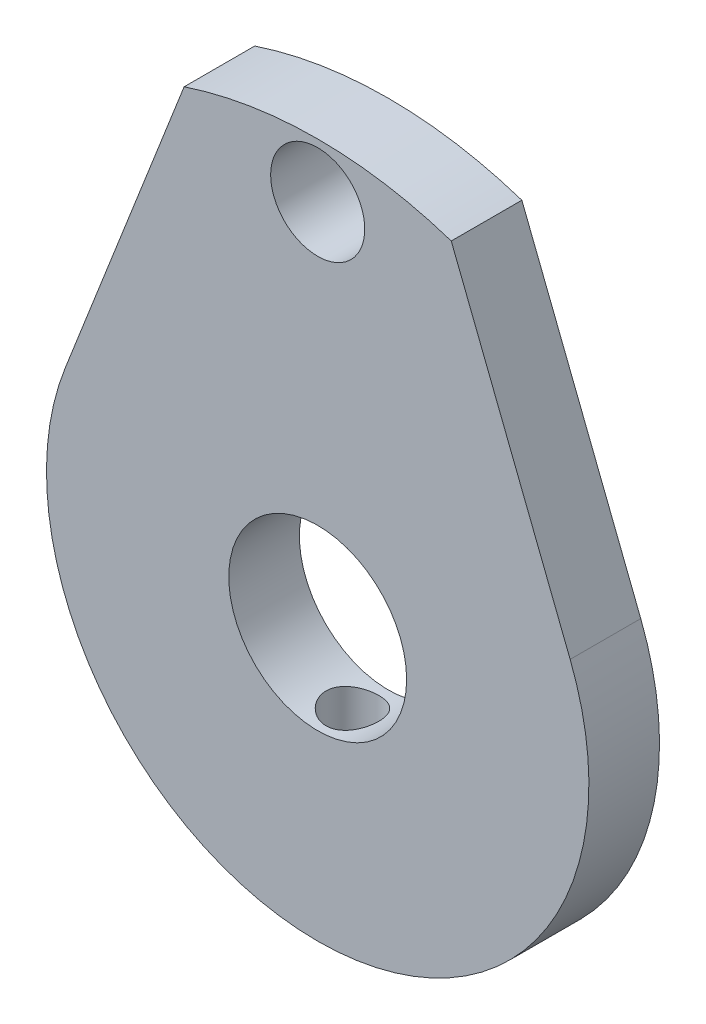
ISO-10303-21;
HEADER;
FILE_DESCRIPTION(('STEP AP214'),'2;1');
FILE_NAME('part.step','',(''),(''),'','','');
FILE_SCHEMA(('AUTOMOTIVE_DESIGN { 1 0 10303 214 1 1 1 1 }'));
ENDSEC;
DATA;
#1=APPLICATION_CONTEXT('core data for automotive mechanical design processes');
#2=APPLICATION_PROTOCOL_DEFINITION('international standard','automotive_design',2000,#1);
#3=PRODUCT_CONTEXT('',#1,'mechanical');
#4=PRODUCT('Part','Part','',(#3));
#5=PRODUCT_RELATED_PRODUCT_CATEGORY('part','',(#4));
#6=PRODUCT_DEFINITION_FORMATION('','',#4);
#7=PRODUCT_DEFINITION_CONTEXT('part definition',#1,'design');
#8=PRODUCT_DEFINITION('design','',#6,#7);
#9=PRODUCT_DEFINITION_SHAPE('','',#8);
#10=(LENGTH_UNIT() NAMED_UNIT(*) SI_UNIT(.MILLI.,.METRE.));
#11=(NAMED_UNIT(*) PLANE_ANGLE_UNIT() SI_UNIT($,.RADIAN.));
#12=(NAMED_UNIT(*) SI_UNIT($,.STERADIAN.) SOLID_ANGLE_UNIT());
#13=UNCERTAINTY_MEASURE_WITH_UNIT(LENGTH_MEASURE(1.E-05),#10,'distance_accuracy_value','');
#14=(GEOMETRIC_REPRESENTATION_CONTEXT(3) GLOBAL_UNCERTAINTY_ASSIGNED_CONTEXT((#13)) GLOBAL_UNIT_ASSIGNED_CONTEXT((#10,
#11,#12)) REPRESENTATION_CONTEXT('',''));
#15=CARTESIAN_POINT('',(0.,0.,0.));
#16=DIRECTION('',(0.,0.,1.));
#17=DIRECTION('',(1.,0.,0.));
#18=AXIS2_PLACEMENT_3D('',#15,#16,#17);
#19=CARTESIAN_POINT('',(0.,0.,0.));
#20=DIRECTION('',(0.,0.,0.999999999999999));
#21=DIRECTION('',(1.,0.,0.));
#22=AXIS2_PLACEMENT_3D('',#19,#20,#21);
#23=CYLINDRICAL_SURFACE('',#22,9.14770787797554);
#24=CARTESIAN_POINT('',(0.,0.,2.38125000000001));
#25=DIRECTION('',(0.,0.,0.999999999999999));
#26=DIRECTION('',(1.,0.,0.));
#27=AXIS2_PLACEMENT_3D('',#24,#25,#26);
#28=CIRCLE('',#27,9.14770787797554);
#29=CARTESIAN_POINT('',(-8.51512171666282,3.34264290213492,2.38125000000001));
#30=VERTEX_POINT('',#29);
#31=CARTESIAN_POINT('',(8.51512171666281,3.34264290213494,2.38125));
#32=VERTEX_POINT('',#31);
#33=EDGE_CURVE('E113',#30,#32,#28,.T.);
#34=ORIENTED_EDGE('',*,*,#33,.F.);
#35=DIRECTION('',(0.,0.,0.999999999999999));
#36=VECTOR('',#35,1.);
#37=CARTESIAN_POINT('',(-8.51512171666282,3.34264290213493,0.));
#38=LINE('',#37,#36);
#39=CARTESIAN_POINT('',(-8.51512171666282,3.34264290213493,0.));
#40=VERTEX_POINT('',#39);
#41=EDGE_CURVE('E68',#40,#30,#38,.T.);
#42=ORIENTED_EDGE('',*,*,#41,.F.);
#43=CARTESIAN_POINT('',(0.,0.,0.));
#44=DIRECTION('',(0.,0.,0.999999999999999));
#45=DIRECTION('',(1.,0.,0.));
#46=AXIS2_PLACEMENT_3D('',#43,#44,#45);
#47=CIRCLE('',#46,9.14770787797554);
#48=CARTESIAN_POINT('',(8.51512171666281,3.34264290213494,0.));
#49=VERTEX_POINT('',#48);
#50=EDGE_CURVE('E97',#40,#49,#47,.T.);
#51=ORIENTED_EDGE('',*,*,#50,.T.);
#52=DIRECTION('',(0.,0.,0.999999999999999));
#53=VECTOR('',#52,1.);
#54=CARTESIAN_POINT('',(8.51512171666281,3.34264290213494,0.));
#55=LINE('',#54,#53);
#56=EDGE_CURVE('E86',#49,#32,#55,.T.);
#57=ORIENTED_EDGE('',*,*,#56,.T.);
#58=EDGE_LOOP('',(#34,#42,#51,#57));
#59=FACE_BOUND('',#58,.T.);
#60=CARTESIAN_POINT('',(0.,-9.14770787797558,0.318766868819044));
#61=CARTESIAN_POINT('',(-0.0498094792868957,-9.14770731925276,0.318769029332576));
#62=CARTESIAN_POINT('',(-0.0996520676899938,-9.14729673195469,0.322967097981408));
#63=CARTESIAN_POINT('',(-0.197955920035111,-9.14569829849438,0.339650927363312));
#64=CARTESIAN_POINT('',(-0.246415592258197,-9.14450959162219,0.352145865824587));
#65=CARTESIAN_POINT('',(-0.340515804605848,-9.14148912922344,0.385056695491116));
#66=CARTESIAN_POINT('',(-0.386158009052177,-9.13965775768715,0.405467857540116));
#67=CARTESIAN_POINT('',(-0.473358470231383,-9.13555685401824,0.453622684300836));
#68=CARTESIAN_POINT('',(-0.514917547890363,-9.13328741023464,0.481364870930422));
#69=CARTESIAN_POINT('',(-0.592923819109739,-9.1285560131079,0.543495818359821));
#70=CARTESIAN_POINT('',(-0.629355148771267,-9.12609349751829,0.577904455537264));
#71=CARTESIAN_POINT('',(-0.695935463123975,-9.1212581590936,0.652349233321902));
#72=CARTESIAN_POINT('',(-0.726084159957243,-9.11888534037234,0.692385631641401));
#73=CARTESIAN_POINT('',(-0.779299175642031,-9.1144922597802,0.77704820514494));
#74=CARTESIAN_POINT('',(-0.802351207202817,-9.11247271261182,0.821683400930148));
#75=CARTESIAN_POINT('',(-0.840627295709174,-9.10902171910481,0.914213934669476));
#76=CARTESIAN_POINT('',(-0.855851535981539,-9.10759025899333,0.962109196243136));
#77=CARTESIAN_POINT('',(-0.877993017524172,-9.10548253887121,1.05963895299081));
#78=CARTESIAN_POINT('',(-0.884936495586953,-9.104803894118,1.10926743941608));
#79=CARTESIAN_POINT('',(-0.890400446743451,-9.10427121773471,1.20898967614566));
#80=CARTESIAN_POINT('',(-0.888921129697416,-9.10441716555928,1.25908341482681));
#81=CARTESIAN_POINT('',(-0.877603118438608,-9.10551500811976,1.35813351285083));
#82=CARTESIAN_POINT('',(-0.867793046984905,-9.10646414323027,1.40709317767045));
#83=CARTESIAN_POINT('',(-0.840136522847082,-9.10905710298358,1.50266781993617));
#84=CARTESIAN_POINT('',(-0.822289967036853,-9.11070093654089,1.54928276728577));
#85=CARTESIAN_POINT('',(-0.779035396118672,-9.11450125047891,1.63893530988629));
#86=CARTESIAN_POINT('',(-0.753614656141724,-9.11665859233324,1.68196672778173));
#87=CARTESIAN_POINT('',(-0.695942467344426,-9.12124210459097,1.76316311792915));
#88=CARTESIAN_POINT('',(-0.663690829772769,-9.12366828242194,1.80132795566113));
#89=CARTESIAN_POINT('',(-0.593112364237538,-9.12852839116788,1.87187416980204));
#90=CARTESIAN_POINT('',(-0.554760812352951,-9.13096231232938,1.90423081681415));
#91=CARTESIAN_POINT('',(-0.473157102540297,-9.13555411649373,1.96205057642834));
#92=CARTESIAN_POINT('',(-0.429904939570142,-9.13771199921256,1.98751368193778));
#93=CARTESIAN_POINT('',(-0.339710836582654,-9.14150924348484,2.03082246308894));
#94=CARTESIAN_POINT('',(-0.292768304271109,-9.14314852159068,2.04866691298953));
#95=CARTESIAN_POINT('',(-0.196533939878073,-9.14572298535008,2.07621386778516));
#96=CARTESIAN_POINT('',(-0.147242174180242,-9.1466581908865,2.08591660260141));
#97=CARTESIAN_POINT('',(-0.0479227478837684,-9.14771658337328,2.09687339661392));
#98=CARTESIAN_POINT('',(0.0021011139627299,-9.14784305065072,2.09816158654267));
#99=CARTESIAN_POINT('',(0.101652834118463,-9.14727850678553,2.09234232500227));
#100=CARTESIAN_POINT('',(0.15118069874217,-9.14658750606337,2.08523498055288));
#101=CARTESIAN_POINT('',(0.248236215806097,-9.14446778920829,2.06285471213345));
#102=CARTESIAN_POINT('',(0.295767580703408,-9.14304051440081,2.04759773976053));
#103=CARTESIAN_POINT('',(0.387596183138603,-9.13960840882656,2.00936767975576));
#104=CARTESIAN_POINT('',(0.431893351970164,-9.13760356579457,1.98639442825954));
#105=CARTESIAN_POINT('',(0.516150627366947,-9.13323249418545,1.93329908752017));
#106=CARTESIAN_POINT('',(0.556096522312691,-9.13086513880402,1.90315454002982));
#107=CARTESIAN_POINT('',(0.630373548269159,-9.12603838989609,1.83660454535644));
#108=CARTESIAN_POINT('',(0.664704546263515,-9.12357899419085,1.8001989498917));
#109=CARTESIAN_POINT('',(0.726895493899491,-9.11883551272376,1.72201150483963));
#110=CARTESIAN_POINT('',(0.754733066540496,-9.11655205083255,1.68021181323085));
#111=CARTESIAN_POINT('',(0.802993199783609,-9.1124283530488,1.59251086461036));
#112=CARTESIAN_POINT('',(0.823415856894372,-9.11058811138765,1.54660966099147));
#113=CARTESIAN_POINT('',(0.856228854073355,-9.10756303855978,1.45208584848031));
#114=CARTESIAN_POINT('',(0.86863257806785,-9.10637711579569,1.40346792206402));
#115=CARTESIAN_POINT('',(0.885099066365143,-9.10479151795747,1.30482735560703));
#116=CARTESIAN_POINT('',(0.889162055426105,-9.10439182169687,1.25480475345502));
#117=CARTESIAN_POINT('',(0.888828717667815,-9.10442435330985,1.15499719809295));
#118=CARTESIAN_POINT('',(0.884467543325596,-9.10485312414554,1.10521212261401));
#119=CARTESIAN_POINT('',(0.86748330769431,-9.10648691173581,1.0070853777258));
#120=CARTESIAN_POINT('',(0.854860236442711,-9.10769192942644,0.95874371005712));
#121=CARTESIAN_POINT('',(0.821720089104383,-9.1107414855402,0.864875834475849));
#122=CARTESIAN_POINT('',(0.801203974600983,-9.11258594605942,0.819349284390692));
#123=CARTESIAN_POINT('',(0.752863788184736,-9.11670671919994,0.732380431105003));
#124=CARTESIAN_POINT('',(0.725039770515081,-9.11898302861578,0.690938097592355));
#125=CARTESIAN_POINT('',(0.662741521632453,-9.1237223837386,0.613133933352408));
#126=CARTESIAN_POINT('',(0.628241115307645,-9.12618614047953,0.576793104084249));
#127=CARTESIAN_POINT('',(0.553620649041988,-9.13101628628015,0.510400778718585));
#128=CARTESIAN_POINT('',(0.513499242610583,-9.1333826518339,0.48035079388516));
#129=CARTESIAN_POINT('',(0.428671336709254,-9.13775722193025,0.427337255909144));
#130=CARTESIAN_POINT('',(0.383954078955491,-9.13976455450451,0.404390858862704));
#131=CARTESIAN_POINT('',(0.291310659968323,-9.14318529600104,0.366362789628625));
#132=CARTESIAN_POINT('',(0.243388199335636,-9.14459937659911,0.351272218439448));
#133=CARTESIAN_POINT('',(0.162660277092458,-9.1463175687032,0.333161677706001));
#134=CARTESIAN_POINT('',(0.1303714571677,-9.14683651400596,0.327770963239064));
#135=CARTESIAN_POINT('',(0.0653931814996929,-9.14753185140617,0.32057285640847));
#136=CARTESIAN_POINT('',(0.03270372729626,-9.14770824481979,0.318765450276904));
#137=CARTESIAN_POINT('',(0.,-9.14770787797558,0.318766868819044));
#138=B_SPLINE_CURVE_WITH_KNOTS('',3,(#60,#61,#62,#63,#64,#65,#66,#67,#68,#69,#70,#71,#72,#73,
#74,#75,#76,#77,#78,#79,#80,#81,#82,#83,#84,#85,#86,#87,#88,#89,#90,#91,#92,#93,#94,#95,#96,#97,
#98,#99,#100,#101,#102,#103,#104,#105,#106,#107,#108,#109,#110,#111,#112,#113,#114,#115,#116,
#117,#118,#119,#120,#121,#122,#123,#124,#125,#126,#127,#128,#129,#130,#131,#132,#133,#134,#135,
#136,#137),.UNSPECIFIED.,.T.,.F.,(4,2,2,2,2,2,2,2,2,2,2,2,2,2,2,2,2,2,2,2,2,2,2,2,2,2,2,2,2,2,2,
2,2,2,2,2,2,2,4),(0.,0.149309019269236,0.298783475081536,0.448168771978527,0.597523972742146,
0.747331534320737,0.897145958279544,1.0472600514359,1.19737062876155,1.34700432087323,
1.49663428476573,1.64575222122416,1.79487207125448,1.94424387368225,2.09361980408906,
2.24361737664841,2.39361510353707,2.54363695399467,2.69365456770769,2.8430633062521,
2.99247014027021,3.1415856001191,3.29070422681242,3.44029614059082,3.58989159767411,
3.73999520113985,3.89009685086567,4.03994732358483,4.18979375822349,4.33901626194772,
4.48823894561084,4.63744345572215,4.78664685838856,4.93644752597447,5.08628413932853,
5.23647985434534,5.38650505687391,5.48453820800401,5.58257098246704),.UNSPECIFIED.);
#139=CARTESIAN_POINT('',(0.,-9.14770787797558,0.318766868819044));
#140=VERTEX_POINT('',#139);
#141=EDGE_CURVE('E12',#140,#140,#138,.T.);
#142=ORIENTED_EDGE('',*,*,#141,.T.);
#143=EDGE_LOOP('',(#142));
#144=FACE_BOUND('',#143,.T.);
#145=ADVANCED_FACE('F41',(#59,#144),#23,.T.);
#146=CARTESIAN_POINT('',(0.,0.,2.38125000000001));
#147=DIRECTION('',(0.,0.,-0.999999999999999));
#148=DIRECTION('',(-1.,0.,0.));
#149=AXIS2_PLACEMENT_3D('',#146,#147,#148);
#150=CYLINDRICAL_SURFACE('',#149,14.2875);
#151=DIRECTION('',(0.,0.,0.999999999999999));
#152=VECTOR('',#151,1.);
#153=CARTESIAN_POINT('',(4.50474769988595,13.5587574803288,0.));
#154=LINE('',#153,#152);
#155=CARTESIAN_POINT('',(4.50474769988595,13.5587574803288,0.));
#156=VERTEX_POINT('',#155);
#157=CARTESIAN_POINT('',(4.50474769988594,13.5587574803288,2.38125));
#158=VERTEX_POINT('',#157);
#159=EDGE_CURVE('E94',#156,#158,#154,.T.);
#160=ORIENTED_EDGE('',*,*,#159,.F.);
#161=CARTESIAN_POINT('',(0.,0.,0.));
#162=DIRECTION('',(0.,0.,0.999999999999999));
#163=DIRECTION('',(1.,0.,0.));
#164=AXIS2_PLACEMENT_3D('',#161,#162,#163);
#165=CIRCLE('',#164,14.2875);
#166=CARTESIAN_POINT('',(-4.50474769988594,13.5587574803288,0.));
#167=VERTEX_POINT('',#166);
#168=EDGE_CURVE('E105',#156,#167,#165,.T.);
#169=ORIENTED_EDGE('',*,*,#168,.T.);
#170=DIRECTION('',(0.,0.,0.999999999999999));
#171=VECTOR('',#170,1.);
#172=CARTESIAN_POINT('',(-4.50474769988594,13.5587574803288,0.));
#173=LINE('',#172,#171);
#174=CARTESIAN_POINT('',(-4.50474769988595,13.5587574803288,2.38125));
#175=VERTEX_POINT('',#174);
#176=EDGE_CURVE('E60',#167,#175,#173,.T.);
#177=ORIENTED_EDGE('',*,*,#176,.T.);
#178=CARTESIAN_POINT('',(0.,0.,2.38125000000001));
#179=DIRECTION('',(0.,0.,0.999999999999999));
#180=DIRECTION('',(1.,0.,0.));
#181=AXIS2_PLACEMENT_3D('',#178,#179,#180);
#182=CIRCLE('',#181,14.2875);
#183=EDGE_CURVE('E53',#158,#175,#182,.T.);
#184=ORIENTED_EDGE('',*,*,#183,.F.);
#185=EDGE_LOOP('',(#160,#169,#177,#184));
#186=FACE_BOUND('',#185,.T.);
#187=ADVANCED_FACE('F43',(#186),#150,.T.);
#188=CARTESIAN_POINT('',(0.,0.,2.38125000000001));
#189=DIRECTION('',(0.,0.,0.999999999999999));
#190=DIRECTION('',(1.,0.,0.));
#191=AXIS2_PLACEMENT_3D('',#188,#189,#190);
#192=PLANE('',#191);
#193=CARTESIAN_POINT('',(0.,0.,2.38125000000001));
#194=DIRECTION('',(0.,0.,0.999999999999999));
#195=DIRECTION('',(1.,0.,0.));
#196=AXIS2_PLACEMENT_3D('',#193,#194,#195);
#197=CIRCLE('',#196,2.999994);
#198=CARTESIAN_POINT('',(2.999994,0.,2.38125000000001));
#199=VERTEX_POINT('',#198);
#200=EDGE_CURVE('E132',#199,#199,#197,.T.);
#201=ORIENTED_EDGE('',*,*,#200,.F.);
#202=EDGE_LOOP('',(#201));
#203=FACE_BOUND('',#202,.T.);
#204=CARTESIAN_POINT('',(0.,12.446,2.38125));
#205=DIRECTION('',(0.,0.,-0.999999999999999));
#206=DIRECTION('',(-1.,0.,0.));
#207=AXIS2_PLACEMENT_3D('',#204,#205,#206);
#208=CIRCLE('',#207,1.5875);
#209=CARTESIAN_POINT('',(-1.5875,12.446,2.38125));
#210=VERTEX_POINT('',#209);
#211=EDGE_CURVE('E120',#210,#210,#208,.T.);
#212=ORIENTED_EDGE('',*,*,#211,.T.);
#213=EDGE_LOOP('',(#212));
#214=FACE_BOUND('',#213,.T.);
#215=ORIENTED_EDGE('',*,*,#33,.T.);
#216=DIRECTION('',(-0.365407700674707,0.930847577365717,0.));
#217=VECTOR('',#216,1.);
#218=CARTESIAN_POINT('',(4.50474769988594,13.5587574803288,2.38125));
#219=LINE('',#218,#217);
#220=EDGE_CURVE('E92',#32,#158,#219,.T.);
#221=ORIENTED_EDGE('',*,*,#220,.T.);
#222=ORIENTED_EDGE('',*,*,#183,.T.);
#223=DIRECTION('',(-0.365407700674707,-0.930847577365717,0.));
#224=VECTOR('',#223,1.);
#225=CARTESIAN_POINT('',(-4.50474769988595,13.5587574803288,2.38125));
#226=LINE('',#225,#224);
#227=EDGE_CURVE('E110',#175,#30,#226,.T.);
#228=ORIENTED_EDGE('',*,*,#227,.T.);
#229=EDGE_LOOP('',(#215,#221,#222,#228));
#230=FACE_BOUND('',#229,.T.);
#231=ADVANCED_FACE('F129',(#203,#214,#230),#192,.T.);
#232=CARTESIAN_POINT('',(0.,0.,0.));
#233=DIRECTION('',(0.,0.,0.999999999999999));
#234=DIRECTION('',(1.,0.,0.));
#235=AXIS2_PLACEMENT_3D('',#232,#233,#234);
#236=PLANE('',#235);
#237=CARTESIAN_POINT('',(0.,0.,0.));
#238=DIRECTION('',(0.,0.,0.999999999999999));
#239=DIRECTION('',(1.,0.,0.));
#240=AXIS2_PLACEMENT_3D('',#237,#238,#239);
#241=CIRCLE('',#240,2.999994);
#242=CARTESIAN_POINT('',(2.999994,0.,0.));
#243=VERTEX_POINT('',#242);
#244=EDGE_CURVE('E114',#243,#243,#241,.T.);
#245=ORIENTED_EDGE('',*,*,#244,.T.);
#246=EDGE_LOOP('',(#245));
#247=FACE_BOUND('',#246,.T.);
#248=CARTESIAN_POINT('',(0.,12.446,0.));
#249=DIRECTION('',(0.,0.,-0.999999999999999));
#250=DIRECTION('',(-1.,0.,0.));
#251=AXIS2_PLACEMENT_3D('',#248,#249,#250);
#252=CIRCLE('',#251,1.5875);
#253=CARTESIAN_POINT('',(-1.5875,12.446,0.));
#254=VERTEX_POINT('',#253);
#255=EDGE_CURVE('E117',#254,#254,#252,.T.);
#256=ORIENTED_EDGE('',*,*,#255,.F.);
#257=EDGE_LOOP('',(#256));
#258=FACE_BOUND('',#257,.T.);
#259=DIRECTION('',(-0.365407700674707,0.930847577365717,0.));
#260=VECTOR('',#259,1.);
#261=CARTESIAN_POINT('',(4.50474769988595,13.5587574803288,0.));
#262=LINE('',#261,#260);
#263=EDGE_CURVE('E89',#49,#156,#262,.T.);
#264=ORIENTED_EDGE('',*,*,#263,.F.);
#265=ORIENTED_EDGE('',*,*,#50,.F.);
#266=DIRECTION('',(-0.365407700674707,-0.930847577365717,0.));
#267=VECTOR('',#266,1.);
#268=CARTESIAN_POINT('',(-4.50474769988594,13.5587574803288,0.));
#269=LINE('',#268,#267);
#270=EDGE_CURVE('E100',#167,#40,#269,.T.);
#271=ORIENTED_EDGE('',*,*,#270,.F.);
#272=ORIENTED_EDGE('',*,*,#168,.F.);
#273=EDGE_LOOP('',(#264,#265,#271,#272));
#274=FACE_BOUND('',#273,.T.);
#275=ADVANCED_FACE('F103',(#247,#258,#274),#236,.F.);
#276=CARTESIAN_POINT('',(0.,12.446,2.38125));
#277=DIRECTION('',(0.,0.,-0.999999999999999));
#278=DIRECTION('',(-1.,0.,0.));
#279=AXIS2_PLACEMENT_3D('',#276,#277,#278);
#280=CYLINDRICAL_SURFACE('',#279,1.5875);
#281=CARTESIAN_POINT('',(-1.5875,12.446,2.38125));
#282=CARTESIAN_POINT('',(-1.5875,12.446,2.3564453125));
#283=CARTESIAN_POINT('',(-1.5875,12.446,2.331640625));
#284=CARTESIAN_POINT('',(-1.5875,12.446,2.28203125));
#285=CARTESIAN_POINT('',(-1.5875,12.446,2.2572265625));
#286=CARTESIAN_POINT('',(-1.5875,12.446,2.2076171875));
#287=CARTESIAN_POINT('',(-1.5875,12.446,2.1828125));
#288=CARTESIAN_POINT('',(-1.5875,12.446,2.133203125));
#289=CARTESIAN_POINT('',(-1.5875,12.446,2.1083984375));
#290=CARTESIAN_POINT('',(-1.5875,12.446,2.0587890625));
#291=CARTESIAN_POINT('',(-1.5875,12.446,2.033984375));
#292=CARTESIAN_POINT('',(-1.5875,12.446,1.984375));
#293=CARTESIAN_POINT('',(-1.5875,12.446,1.9595703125));
#294=CARTESIAN_POINT('',(-1.5875,12.446,1.9099609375));
#295=CARTESIAN_POINT('',(-1.5875,12.446,1.88515625));
#296=CARTESIAN_POINT('',(-1.5875,12.446,1.835546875));
#297=CARTESIAN_POINT('',(-1.5875,12.446,1.8107421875));
#298=CARTESIAN_POINT('',(-1.5875,12.446,1.7611328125));
#299=CARTESIAN_POINT('',(-1.5875,12.446,1.736328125));
#300=CARTESIAN_POINT('',(-1.5875,12.446,1.68671875));
#301=CARTESIAN_POINT('',(-1.5875,12.446,1.6619140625));
#302=CARTESIAN_POINT('',(-1.5875,12.446,1.6123046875));
#303=CARTESIAN_POINT('',(-1.5875,12.446,1.5875));
#304=CARTESIAN_POINT('',(-1.5875,12.446,1.537890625));
#305=CARTESIAN_POINT('',(-1.5875,12.446,1.5130859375));
#306=CARTESIAN_POINT('',(-1.5875,12.446,1.4634765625));
#307=CARTESIAN_POINT('',(-1.5875,12.446,1.438671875));
#308=CARTESIAN_POINT('',(-1.5875,12.446,1.3890625));
#309=CARTESIAN_POINT('',(-1.5875,12.446,1.3642578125));
#310=CARTESIAN_POINT('',(-1.5875,12.446,1.3146484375));
#311=CARTESIAN_POINT('',(-1.5875,12.446,1.28984375));
#312=CARTESIAN_POINT('',(-1.5875,12.446,1.240234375));
#313=CARTESIAN_POINT('',(-1.5875,12.446,1.2154296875));
#314=CARTESIAN_POINT('',(-1.5875,12.446,1.1658203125));
#315=CARTESIAN_POINT('',(-1.5875,12.446,1.141015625));
#316=CARTESIAN_POINT('',(-1.5875,12.446,1.09140625));
#317=CARTESIAN_POINT('',(-1.5875,12.446,1.0666015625));
#318=CARTESIAN_POINT('',(-1.5875,12.446,1.01699218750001));
#319=CARTESIAN_POINT('',(-1.5875,12.446,0.992187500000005));
#320=CARTESIAN_POINT('',(-1.5875,12.446,0.942578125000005));
#321=CARTESIAN_POINT('',(-1.5875,12.446,0.917773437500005));
#322=CARTESIAN_POINT('',(-1.5875,12.446,0.868164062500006));
#323=CARTESIAN_POINT('',(-1.5875,12.446,0.843359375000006));
#324=CARTESIAN_POINT('',(-1.5875,12.446,0.793750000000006));
#325=CARTESIAN_POINT('',(-1.5875,12.446,0.768945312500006));
#326=CARTESIAN_POINT('',(-1.5875,12.446,0.719335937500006));
#327=CARTESIAN_POINT('',(-1.5875,12.446,0.694531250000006));
#328=CARTESIAN_POINT('',(-1.5875,12.446,0.644921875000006));
#329=CARTESIAN_POINT('',(-1.5875,12.446,0.620117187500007));
#330=CARTESIAN_POINT('',(-1.5875,12.446,0.570507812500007));
#331=CARTESIAN_POINT('',(-1.5875,12.446,0.545703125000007));
#332=CARTESIAN_POINT('',(-1.5875,12.446,0.496093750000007));
#333=CARTESIAN_POINT('',(-1.5875,12.446,0.471289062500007));
#334=CARTESIAN_POINT('',(-1.5875,12.446,0.421679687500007));
#335=CARTESIAN_POINT('',(-1.5875,12.446,0.396875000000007));
#336=CARTESIAN_POINT('',(-1.5875,12.446,0.347265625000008));
#337=CARTESIAN_POINT('',(-1.5875,12.446,0.322460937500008));
#338=CARTESIAN_POINT('',(-1.5875,12.446,0.272851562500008));
#339=CARTESIAN_POINT('',(-1.5875,12.446,0.248046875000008));
#340=CARTESIAN_POINT('',(-1.5875,12.446,0.198437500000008));
#341=CARTESIAN_POINT('',(-1.5875,12.446,0.173632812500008));
#342=CARTESIAN_POINT('',(-1.5875,12.446,0.124023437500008));
#343=CARTESIAN_POINT('',(-1.5875,12.446,0.0992187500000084));
#344=CARTESIAN_POINT('',(-1.5875,12.446,0.0496093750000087));
#345=CARTESIAN_POINT('',(-1.5875,12.446,0.0248046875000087));
#346=CARTESIAN_POINT('',(-1.5875,12.446,0.));
#347=B_SPLINE_CURVE_WITH_KNOTS('',3,(#281,#282,#283,#284,#285,#286,#287,#288,#289,#290,#291,
#292,#293,#294,#295,#296,#297,#298,#299,#300,#301,#302,#303,#304,#305,#306,#307,#308,#309,#310,
#311,#312,#313,#314,#315,#316,#317,#318,#319,#320,#321,#322,#323,#324,#325,#326,#327,#328,#329,
#330,#331,#332,#333,#334,#335,#336,#337,#338,#339,#340,#341,#342,#343,#344,#345,#346),
.UNSPECIFIED.,.F.,.F.,(4,2,2,2,2,2,2,2,2,2,2,2,2,2,2,2,2,2,2,2,2,2,2,2,2,2,2,2,2,2,2,2,4),(0.,
0.0744140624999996,0.148828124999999,0.223242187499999,0.297656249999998,0.372070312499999,
0.446484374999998,0.520898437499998,0.595312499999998,0.669726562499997,0.744140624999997,
0.818554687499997,0.892968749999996,0.967382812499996,1.041796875,1.1162109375,1.190625,
1.2650390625,1.33945312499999,1.41386718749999,1.48828124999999,1.56269531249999,
1.63710937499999,1.71152343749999,1.78593749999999,1.86035156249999,1.93476562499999,
2.00917968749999,2.08359374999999,2.15800781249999,2.23242187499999,2.30683593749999,
2.38124999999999),.UNSPECIFIED.);
#348=EDGE_CURVE('BSEAM155',#210,#254,#347,.T.);
#349=ORIENTED_EDGE('',*,*,#211,.F.);
#350=ORIENTED_EDGE('',*,*,#255,.T.);
#351=ORIENTED_EDGE('',*,*,#348,.T.);
#352=ORIENTED_EDGE('',*,*,#348,.F.);
#353=EDGE_LOOP('',(#349,#351,#350,#352));
#354=FACE_BOUND('',#353,.T.);
#355=ADVANCED_FACE('F155',(#354),#280,.F.);
#356=CARTESIAN_POINT('',(4.50474769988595,13.5587574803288,0.));
#357=DIRECTION('',(0.930847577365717,0.365407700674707,0.));
#358=DIRECTION('',(-0.365407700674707,0.930847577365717,0.));
#359=AXIS2_PLACEMENT_3D('',#356,#357,#358);
#360=PLANE('',#359);
#361=ORIENTED_EDGE('',*,*,#220,.F.);
#362=ORIENTED_EDGE('',*,*,#56,.F.);
#363=ORIENTED_EDGE('',*,*,#263,.T.);
#364=ORIENTED_EDGE('',*,*,#159,.T.);
#365=EDGE_LOOP('',(#361,#362,#363,#364));
#366=FACE_BOUND('',#365,.T.);
#367=ADVANCED_FACE('F87',(#366),#360,.T.);
#368=CARTESIAN_POINT('',(-4.50474769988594,13.5587574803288,0.));
#369=DIRECTION('',(-0.930847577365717,0.365407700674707,0.));
#370=DIRECTION('',(-0.365407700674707,-0.930847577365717,0.));
#371=AXIS2_PLACEMENT_3D('',#368,#369,#370);
#372=PLANE('',#371);
#373=ORIENTED_EDGE('',*,*,#227,.F.);
#374=ORIENTED_EDGE('',*,*,#176,.F.);
#375=ORIENTED_EDGE('',*,*,#270,.T.);
#376=ORIENTED_EDGE('',*,*,#41,.T.);
#377=EDGE_LOOP('',(#373,#374,#375,#376));
#378=FACE_BOUND('',#377,.T.);
#379=ADVANCED_FACE('F130',(#378),#372,.T.);
#380=CARTESIAN_POINT('',(0.,0.,0.));
#381=DIRECTION('',(0.,0.,0.999999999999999));
#382=DIRECTION('',(1.,0.,0.));
#383=AXIS2_PLACEMENT_3D('',#380,#381,#382);
#384=CYLINDRICAL_SURFACE('',#383,2.999994);
#385=CARTESIAN_POINT('',(0.,-2.99999399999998,0.31876686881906));
#386=CARTESIAN_POINT('',(0.0487971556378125,-2.99999353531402,0.318767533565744));
#387=CARTESIAN_POINT('',(0.0976010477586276,-2.99879199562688,0.322797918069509));
#388=CARTESIAN_POINT('',(0.193789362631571,-2.99411611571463,0.338775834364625));
#389=CARTESIAN_POINT('',(0.241173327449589,-2.99064105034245,0.350725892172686));
#390=CARTESIAN_POINT('',(0.333120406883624,-2.98179921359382,0.382110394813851));
#391=CARTESIAN_POINT('',(0.377687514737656,-2.97643519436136,0.401533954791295));
#392=CARTESIAN_POINT('',(0.462932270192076,-2.96437404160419,0.447269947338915));
#393=CARTESIAN_POINT('',(0.503609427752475,-2.95767674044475,0.473583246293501));
#394=CARTESIAN_POINT('',(0.581061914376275,-2.94345409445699,0.533130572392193));
#395=CARTESIAN_POINT('',(0.617712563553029,-2.93591209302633,0.566522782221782));
#396=CARTESIAN_POINT('',(0.684984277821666,-2.92095028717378,0.638942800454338));
#397=CARTESIAN_POINT('',(0.715604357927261,-2.91353050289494,0.677971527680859));
#398=CARTESIAN_POINT('',(0.770596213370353,-2.89947769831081,0.761604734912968));
#399=CARTESIAN_POINT('',(0.794816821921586,-2.89286541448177,0.806312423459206));
#400=CARTESIAN_POINT('',(0.835345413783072,-2.88142476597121,0.899393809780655));
#401=CARTESIAN_POINT('',(0.851655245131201,-2.8765959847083,0.947766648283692));
#402=CARTESIAN_POINT('',(0.875451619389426,-2.86944246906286,1.04540724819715));
#403=CARTESIAN_POINT('',(0.883167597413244,-2.86705277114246,1.09461420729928));
#404=CARTESIAN_POINT('',(0.890273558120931,-2.86485463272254,1.19367775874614));
#405=CARTESIAN_POINT('',(0.889665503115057,-2.86504558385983,1.24353419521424));
#406=CARTESIAN_POINT('',(0.880321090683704,-2.86792952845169,1.34062459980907));
#407=CARTESIAN_POINT('',(0.8718710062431,-2.8705343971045,1.38788916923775));
#408=CARTESIAN_POINT('',(0.847544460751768,-2.87781027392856,1.480297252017));
#409=CARTESIAN_POINT('',(0.831667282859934,-2.88248148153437,1.52544056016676));
#410=CARTESIAN_POINT('',(0.792723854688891,-2.89343484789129,1.61303014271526));
#411=CARTESIAN_POINT('',(0.769563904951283,-2.89973780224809,1.65543204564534));
#412=CARTESIAN_POINT('',(0.716777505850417,-2.91323434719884,1.73584408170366));
#413=CARTESIAN_POINT('',(0.687149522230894,-2.92042814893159,1.77385316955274));
#414=CARTESIAN_POINT('',(0.620841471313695,-2.93525432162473,1.84602575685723));
#415=CARTESIAN_POINT('',(0.583923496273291,-2.9428926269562,1.87996982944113));
#416=CARTESIAN_POINT('',(0.504824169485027,-2.95748740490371,1.94123546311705));
#417=CARTESIAN_POINT('',(0.46264250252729,-2.964443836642,1.96855662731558));
#418=CARTESIAN_POINT('',(0.373821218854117,-2.97695200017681,2.01592979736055));
#419=CARTESIAN_POINT('',(0.327154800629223,-2.98249445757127,2.03593416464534));
#420=CARTESIAN_POINT('',(0.230917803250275,-2.99148336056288,2.06774618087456));
#421=CARTESIAN_POINT('',(0.181348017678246,-2.99493037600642,2.07955605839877));
#422=CARTESIAN_POINT('',(0.0825776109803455,-2.9992503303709,2.09428095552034));
#423=CARTESIAN_POINT('',(0.0334250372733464,-3.00020932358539,2.09749346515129));
#424=CARTESIAN_POINT('',(-0.0647195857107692,-2.99969706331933,2.09576484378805));
#425=CARTESIAN_POINT('',(-0.113711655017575,-2.99822612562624,2.090824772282));
#426=CARTESIAN_POINT('',(-0.209028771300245,-2.9930755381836,2.07317221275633));
#427=CARTESIAN_POINT('',(-0.255388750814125,-2.9894450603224,2.06063264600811));
#428=CARTESIAN_POINT('',(-0.345337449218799,-2.98039447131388,2.02834425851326));
#429=CARTESIAN_POINT('',(-0.388925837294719,-2.97497414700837,2.00859457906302));
#430=CARTESIAN_POINT('',(-0.473195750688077,-2.96275297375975,1.96194126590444));
#431=CARTESIAN_POINT('',(-0.513788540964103,-2.95592351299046,1.93488504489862));
#432=CARTESIAN_POINT('',(-0.58995943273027,-2.94166891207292,1.87457279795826));
#433=CARTESIAN_POINT('',(-0.625536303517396,-2.93424362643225,1.84131525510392));
#434=CARTESIAN_POINT('',(-0.691969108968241,-2.91930546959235,1.76814745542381));
#435=CARTESIAN_POINT('',(-0.722613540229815,-2.91179879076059,1.72804348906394));
#436=CARTESIAN_POINT('',(-0.776751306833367,-2.89782779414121,1.64309950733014));
#437=CARTESIAN_POINT('',(-0.800244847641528,-2.89136344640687,1.59825962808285));
#438=CARTESIAN_POINT('',(-0.839249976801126,-2.88028386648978,1.50527177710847));
#439=CARTESIAN_POINT('',(-0.8548002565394,-2.87565969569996,1.45714116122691));
#440=CARTESIAN_POINT('',(-0.877531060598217,-2.86880583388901,1.35878264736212));
#441=CARTESIAN_POINT('',(-0.884714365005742,-2.86657534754,1.3085554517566));
#442=CARTESIAN_POINT('',(-0.890321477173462,-2.86483842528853,1.20962290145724));
#443=CARTESIAN_POINT('',(-0.889089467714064,-2.86522494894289,1.1609386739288));
#444=CARTESIAN_POINT('',(-0.878719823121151,-2.86842191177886,1.06450479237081));
#445=CARTESIAN_POINT('',(-0.869582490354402,-2.87123225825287,1.01675510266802));
#446=CARTESIAN_POINT('',(-0.843881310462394,-2.87888929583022,0.924093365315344));
#447=CARTESIAN_POINT('',(-0.827406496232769,-2.88371153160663,0.879154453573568));
#448=CARTESIAN_POINT('',(-0.787567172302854,-2.89484503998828,0.792642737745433));
#449=CARTESIAN_POINT('',(-0.764201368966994,-2.90115659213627,0.751070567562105));
#450=CARTESIAN_POINT('',(-0.710267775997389,-2.91483838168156,0.670869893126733));
#451=CARTESIAN_POINT('',(-0.67947297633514,-2.92223833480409,0.632399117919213));
#452=CARTESIAN_POINT('',(-0.611966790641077,-2.93711652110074,0.561059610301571));
#453=CARTESIAN_POINT('',(-0.575253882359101,-2.94459477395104,0.528192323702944));
#454=CARTESIAN_POINT('',(-0.495702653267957,-2.95904048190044,0.468067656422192));
#455=CARTESIAN_POINT('',(-0.452720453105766,-2.96598750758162,0.440995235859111));
#456=CARTESIAN_POINT('',(-0.362608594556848,-2.97834547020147,0.394499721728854));
#457=CARTESIAN_POINT('',(-0.315480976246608,-2.98375715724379,0.375072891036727));
#458=CARTESIAN_POINT('',(-0.223947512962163,-2.991935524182,0.346254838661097));
#459=CARTESIAN_POINT('',(-0.1798406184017,-2.99493283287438,0.335974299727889));
#460=CARTESIAN_POINT('',(-0.0904909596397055,-2.99896213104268,0.322230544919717));
#461=CARTESIAN_POINT('',(-0.0452483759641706,-2.9999944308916,0.318766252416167));
#462=CARTESIAN_POINT('',(0.,-2.99999399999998,0.31876686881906));
#463=B_SPLINE_CURVE_WITH_KNOTS('',3,(#385,#386,#387,#388,#389,#390,#391,#392,#393,#394,#395,
#396,#397,#398,#399,#400,#401,#402,#403,#404,#405,#406,#407,#408,#409,#410,#411,#412,#413,#414,
#415,#416,#417,#418,#419,#420,#421,#422,#423,#424,#425,#426,#427,#428,#429,#430,#431,#432,#433,
#434,#435,#436,#437,#438,#439,#440,#441,#442,#443,#444,#445,#446,#447,#448,#449,#450,#451,#452,
#453,#454,#455,#456,#457,#458,#459,#460,#461,#462),.UNSPECIFIED.,.T.,.F.,(4,2,2,2,2,2,2,2,2,2,2,
2,2,2,2,2,2,2,2,2,2,2,2,2,2,2,2,2,2,2,2,2,2,2,2,2,2,2,4),(0.,0.146225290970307,
0.292497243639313,0.438556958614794,0.584635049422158,0.734407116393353,0.88420362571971,
1.03727363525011,1.19030786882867,1.33915047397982,1.48795799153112,1.63153835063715,
1.77513257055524,1.92065555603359,2.06621309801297,2.21769377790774,2.36918353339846,
2.52164276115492,2.67406050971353,2.82113159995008,2.96818357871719,3.11200893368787,
3.25585142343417,3.40296762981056,3.55011986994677,3.7024772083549,3.85483016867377,
4.00643377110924,4.15798698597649,4.3033799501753,4.44876735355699,4.59243675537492,
4.73613314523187,4.88495115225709,5.03380749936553,5.186874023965,5.33986563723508,
5.4754780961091,5.61106913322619),.UNSPECIFIED.);
#464=CARTESIAN_POINT('',(0.,-2.99999399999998,0.31876686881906));
#465=VERTEX_POINT('',#464);
#466=EDGE_CURVE('E135',#465,#465,#463,.T.);
#467=ORIENTED_EDGE('',*,*,#466,.T.);
#468=EDGE_LOOP('',(#467));
#469=FACE_BOUND('',#468,.T.);
#470=ORIENTED_EDGE('',*,*,#244,.F.);
#471=EDGE_LOOP('',(#470));
#472=FACE_BOUND('',#471,.T.);
#473=ORIENTED_EDGE('',*,*,#200,.T.);
#474=EDGE_LOOP('',(#473));
#475=FACE_BOUND('',#474,.T.);
#476=ADVANCED_FACE('F149',(#469,#472,#475),#384,.F.);
#477=CARTESIAN_POINT('',(0.,-8.8937078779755,1.20776686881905));
#478=DIRECTION('',(0.,-1.,0.));
#479=DIRECTION('',(0.,0.,-0.999999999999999));
#480=AXIS2_PLACEMENT_3D('',#477,#478,#479);
#481=CYLINDRICAL_SURFACE('',#480,0.889);
#482=ORIENTED_EDGE('',*,*,#141,.F.);
#483=EDGE_LOOP('',(#482));
#484=FACE_BOUND('',#483,.T.);
#485=ORIENTED_EDGE('',*,*,#466,.F.);
#486=EDGE_LOOP('',(#485));
#487=FACE_BOUND('',#486,.T.);
#488=ADVANCED_FACE('F145',(#484,#487),#481,.F.);
#489=CLOSED_SHELL('',(#145,#187,#231,#275,#355,#367,#379,#476,#488));
#490=MANIFOLD_SOLID_BREP('B2',#489);
#491=ADVANCED_BREP_SHAPE_REPRESENTATION('',(#18,#490),#14);
#492=SHAPE_DEFINITION_REPRESENTATION(#9,#491);
ENDSEC;
END-ISO-10303-21;
